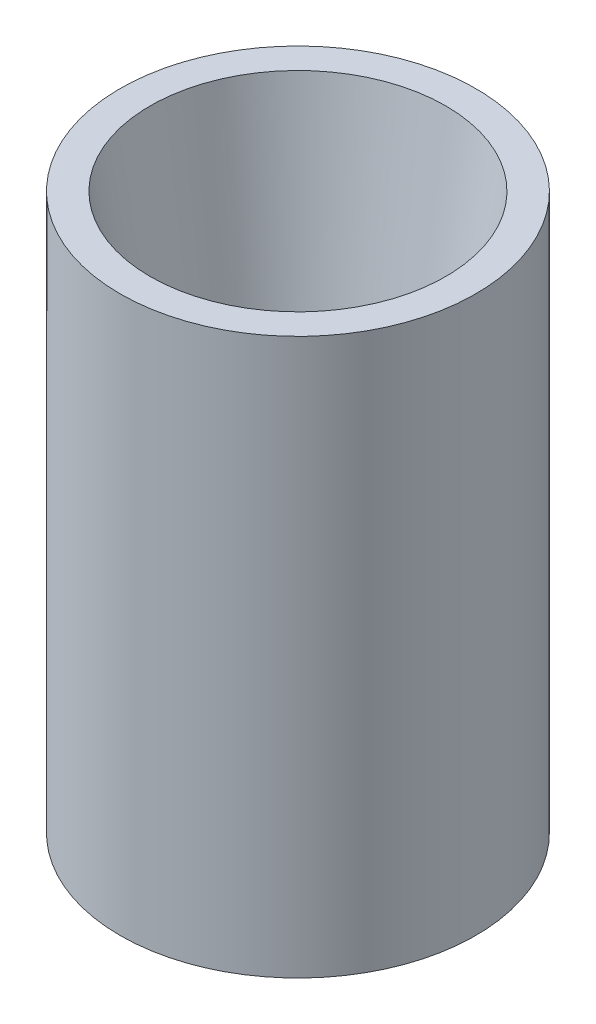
ISO-10303-21;
HEADER;
FILE_DESCRIPTION(('STEP AP214'),'2;1');
FILE_NAME('part.step','',(''),(''),'','','');
FILE_SCHEMA(('AUTOMOTIVE_DESIGN { 1 0 10303 214 1 1 1 1 }'));
ENDSEC;
DATA;
#1=APPLICATION_CONTEXT('core data for automotive mechanical design processes');
#2=APPLICATION_PROTOCOL_DEFINITION('international standard','automotive_design',2000,#1);
#3=PRODUCT_CONTEXT('',#1,'mechanical');
#4=PRODUCT('Part','Part','',(#3));
#5=PRODUCT_RELATED_PRODUCT_CATEGORY('part','',(#4));
#6=PRODUCT_DEFINITION_FORMATION('','',#4);
#7=PRODUCT_DEFINITION_CONTEXT('part definition',#1,'design');
#8=PRODUCT_DEFINITION('design','',#6,#7);
#9=PRODUCT_DEFINITION_SHAPE('','',#8);
#10=(LENGTH_UNIT() NAMED_UNIT(*) SI_UNIT(.MILLI.,.METRE.));
#11=(NAMED_UNIT(*) PLANE_ANGLE_UNIT() SI_UNIT($,.RADIAN.));
#12=(NAMED_UNIT(*) SI_UNIT($,.STERADIAN.) SOLID_ANGLE_UNIT());
#13=UNCERTAINTY_MEASURE_WITH_UNIT(LENGTH_MEASURE(1.E-05),#10,'distance_accuracy_value','');
#14=(GEOMETRIC_REPRESENTATION_CONTEXT(3) GLOBAL_UNCERTAINTY_ASSIGNED_CONTEXT((#13)) GLOBAL_UNIT_ASSIGNED_CONTEXT((#10,
#11,#12)) REPRESENTATION_CONTEXT('',''));
#15=CARTESIAN_POINT('',(0.,0.,0.));
#16=DIRECTION('',(0.,0.,1.));
#17=DIRECTION('',(1.,0.,0.));
#18=AXIS2_PLACEMENT_3D('',#15,#16,#17);
#19=CARTESIAN_POINT('',(0.,24.9999999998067,0.));
#20=DIRECTION('',(0.,1.,0.));
#21=DIRECTION('',(0.,0.,1.00000000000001));
#22=AXIS2_PLACEMENT_3D('',#19,#20,#21);
#23=CONICAL_SURFACE('',#22,6.65009919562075,0.152094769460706);
#24=CARTESIAN_POINT('',(0.,24.9999999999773,0.));
#25=DIRECTION('',(0.,1.,0.));
#26=DIRECTION('',(0.,0.,1.00000000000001));
#27=AXIS2_PLACEMENT_3D('',#24,#25,#26);
#28=CIRCLE('',#27,6.65009919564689);
#29=CARTESIAN_POINT('',(0.,24.9999999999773,6.65009919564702));
#30=VERTEX_POINT('',#29);
#31=EDGE_CURVE('E18',#30,#30,#28,.F.);
#32=ORIENTED_EDGE('',*,*,#31,.F.);
#33=EDGE_LOOP('',(#32));
#34=FACE_BOUND('',#33,.T.);
#35=CARTESIAN_POINT('',(0.,10.9725992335,0.));
#36=DIRECTION('',(0.,1.,0.));
#37=DIRECTION('',(0.,0.,1.00000000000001));
#38=AXIS2_PLACEMENT_3D('',#35,#36,#37);
#39=CIRCLE('',#38,4.5);
#40=CARTESIAN_POINT('',(0.,10.9725992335,4.50000000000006));
#41=VERTEX_POINT('',#40);
#42=EDGE_CURVE('E30',#41,#41,#39,.F.);
#43=ORIENTED_EDGE('',*,*,#42,.T.);
#44=EDGE_LOOP('',(#43));
#45=FACE_BOUND('',#44,.T.);
#46=ADVANCED_FACE('F14',(#34,#45),#23,.F.);
#47=CARTESIAN_POINT('',(0.,12.5,0.));
#48=DIRECTION('',(0.,1.,0.));
#49=DIRECTION('',(0.,0.,1.00000000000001));
#50=AXIS2_PLACEMENT_3D('',#47,#48,#49);
#51=CYLINDRICAL_SURFACE('',#50,4.5);
#52=ORIENTED_EDGE('',*,*,#42,.F.);
#53=EDGE_LOOP('',(#52));
#54=FACE_BOUND('',#53,.T.);
#55=CARTESIAN_POINT('',(0.,0.,0.));
#56=DIRECTION('',(0.,1.,0.));
#57=DIRECTION('',(0.,0.,1.00000000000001));
#58=AXIS2_PLACEMENT_3D('',#55,#56,#57);
#59=CIRCLE('',#58,4.5);
#60=CARTESIAN_POINT('',(0.,0.,4.50000000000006));
#61=VERTEX_POINT('',#60);
#62=EDGE_CURVE('E27',#61,#61,#59,.F.);
#63=ORIENTED_EDGE('',*,*,#62,.T.);
#64=EDGE_LOOP('',(#63));
#65=FACE_BOUND('',#64,.T.);
#66=ADVANCED_FACE('F41',(#54,#65),#51,.F.);
#67=CARTESIAN_POINT('',(0.,25.,6.65009919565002));
#68=DIRECTION('',(0.,1.,0.));
#69=DIRECTION('',(0.,0.,1.00000000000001));
#70=AXIS2_PLACEMENT_3D('',#67,#68,#69);
#71=PLANE('',#70);
#72=ORIENTED_EDGE('',*,*,#31,.T.);
#73=EDGE_LOOP('',(#72));
#74=FACE_BOUND('',#73,.T.);
#75=CARTESIAN_POINT('',(0.,25.,0.));
#76=DIRECTION('',(0.,1.,0.));
#77=DIRECTION('',(0.,0.,1.00000000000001));
#78=AXIS2_PLACEMENT_3D('',#75,#76,#77);
#79=CIRCLE('',#78,8.);
#80=CARTESIAN_POINT('',(0.,25.,8.00000000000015));
#81=VERTEX_POINT('',#80);
#82=EDGE_CURVE('E22',#81,#81,#79,.F.);
#83=ORIENTED_EDGE('',*,*,#82,.F.);
#84=EDGE_LOOP('',(#83));
#85=FACE_BOUND('',#84,.T.);
#86=ADVANCED_FACE('F43',(#74,#85),#71,.T.);
#87=CARTESIAN_POINT('',(0.,0.,8.00000000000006));
#88=DIRECTION('',(0.,1.,0.));
#89=DIRECTION('',(0.,0.,1.00000000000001));
#90=AXIS2_PLACEMENT_3D('',#87,#88,#89);
#91=PLANE('',#90);
#92=ORIENTED_EDGE('',*,*,#62,.F.);
#93=EDGE_LOOP('',(#92));
#94=FACE_BOUND('',#93,.T.);
#95=CARTESIAN_POINT('',(0.,0.,0.));
#96=DIRECTION('',(0.,1.,0.));
#97=DIRECTION('',(0.,0.,1.00000000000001));
#98=AXIS2_PLACEMENT_3D('',#95,#96,#97);
#99=CIRCLE('',#98,8.);
#100=CARTESIAN_POINT('',(0.,0.,8.00000000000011));
#101=VERTEX_POINT('',#100);
#102=EDGE_CURVE('E10',#101,#101,#99,.T.);
#103=ORIENTED_EDGE('',*,*,#102,.F.);
#104=EDGE_LOOP('',(#103));
#105=FACE_BOUND('',#104,.T.);
#106=ADVANCED_FACE('F50',(#94,#105),#91,.F.);
#107=CARTESIAN_POINT('',(0.,12.5,0.));
#108=DIRECTION('',(0.,1.,0.));
#109=DIRECTION('',(0.,0.,1.00000000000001));
#110=AXIS2_PLACEMENT_3D('',#107,#108,#109);
#111=CYLINDRICAL_SURFACE('',#110,8.);
#112=ORIENTED_EDGE('',*,*,#102,.T.);
#113=EDGE_LOOP('',(#112));
#114=FACE_BOUND('',#113,.T.);
#115=ORIENTED_EDGE('',*,*,#82,.T.);
#116=EDGE_LOOP('',(#115));
#117=FACE_BOUND('',#116,.T.);
#118=ADVANCED_FACE('F16',(#114,#117),#111,.T.);
#119=CLOSED_SHELL('',(#46,#66,#86,#106,#118));
#120=MANIFOLD_SOLID_BREP('B1',#119);
#121=ADVANCED_BREP_SHAPE_REPRESENTATION('',(#18,#120),#14);
#122=SHAPE_DEFINITION_REPRESENTATION(#9,#121);
ENDSEC;
END-ISO-10303-21;
